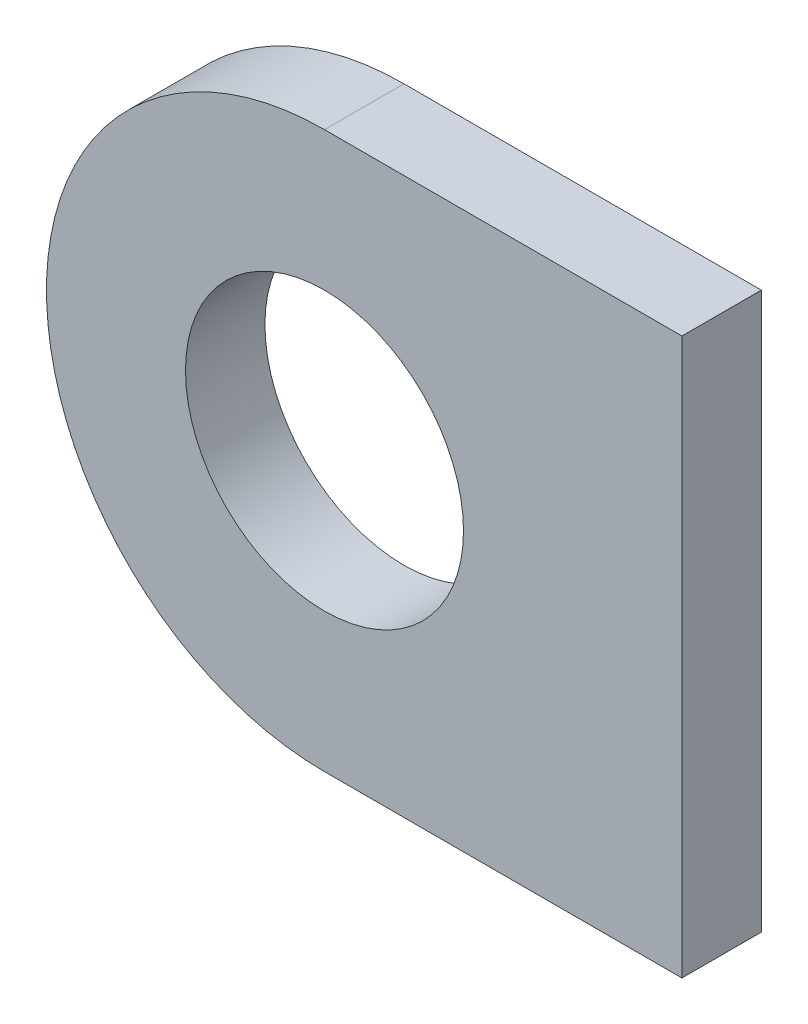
from build123d import *

# Parameters (mm, degrees)
SKETCH1_R           = 17.5
BOSS_EXTRUDE1_DEPTH = 10


with BuildPart() as part:
    # Sketch1 → Boss-Extrude1 (new body)
    with BuildSketch(Plane.XY):
        with BuildLine():
            Line((0, 0), (-45, 0))
            ThreePointArc((-45, 0), (-80, -35), (-45, -70))
            Line((-45, -70), (0, -70))
            Line((0, -70), (0, 0))
        make_face()
        with Locations((-45, -35)):
            Circle(SKETCH1_R, mode=Mode.SUBTRACT)
    extrude(amount=BOSS_EXTRUDE1_DEPTH)


solid = part.part
